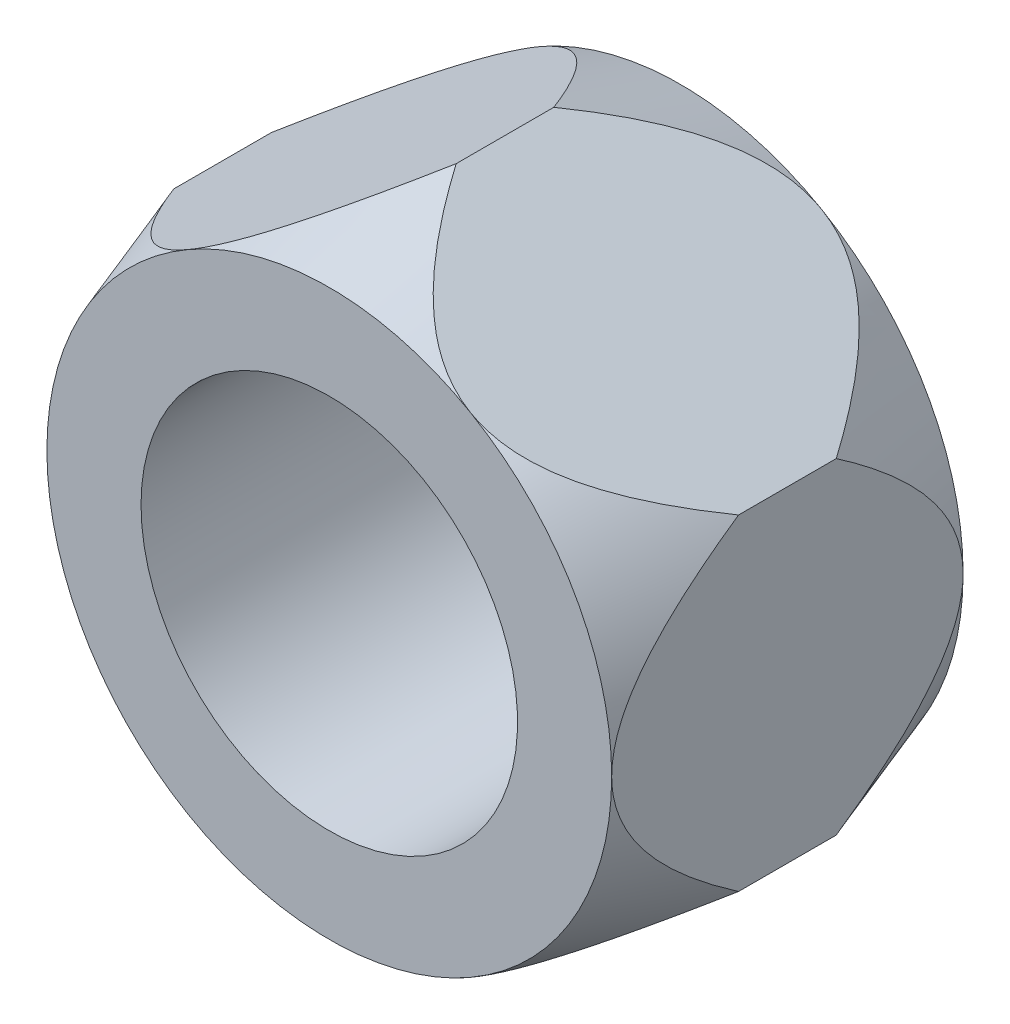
from build123d import *

# Parameters (mm, degrees)
BOSS_EXTRUDE1_DEPTH = 2.8
SKETCH2_OUTSIDE_W   = 9.912
SKETCH2_OUTSIDE_H   = 10.608
SKETCH2_OUTSIDE_R   = 2.25
CUT_EXTRUDE1_DEPTH  = 2.8
CUT_EXTRUDE1_DRAFT  = -19
SKETCH3_OUTSIDE_W   = 9.912
SKETCH3_OUTSIDE_H   = 10.608
SKETCH3_OUTSIDE_R   = 2.25
CUT_EXTRUDE2_DEPTH  = 2.8
CUT_EXTRUDE2_DRAFT  = -19
SKETCH4_R           = 1.5
CUT_EXTRUDE3_DEPTH  = 2.8


with BuildPart() as part:
    # Sketch1 → Boss-Extrude1 (new body)
    with BuildSketch(Plane.XY):
        Polygon((0, 2.598076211), (-2.25, 1.299038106), (-2.25, -1.299038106), (0, -2.598076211), (2.25, -1.299038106), (2.25, 1.299038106), align=None)
    extrude(amount=BOSS_EXTRUDE1_DEPTH)


with BuildPart() as cut_extrude1_tool:
    # Sketch2 outside → Cut-Extrude1 (with draft: the straight prism first)
    with BuildSketch(Plane.XY.offset(2.8)):
        Rectangle(SKETCH2_OUTSIDE_W, SKETCH2_OUTSIDE_H)
        Circle(SKETCH2_OUTSIDE_R, mode=Mode.SUBTRACT)
    extrude(amount=-CUT_EXTRUDE1_DEPTH)
    # Cut-Extrude1: the draft: its side faces are tilted about the plane it starts from
    cut_extrude1_sides = [cut_extrude1_tool.faces().sort_by_distance(p)[0] for p in [
        (0, -5.304, 1.4),
        (4.956, 0, 1.4),
        (0, 5.304, 1.4),
        (-4.956, 0, 1.4),
        (-2.25, 0, 1.4),
    ]]
    draft(cut_extrude1_sides, Plane.XY.offset(2.8), CUT_EXTRUDE1_DRAFT)


with BuildPart() as part_1:
    add(part.part)

    # Cut-Extrude1: cut by cut_extrude1_tool
    add(cut_extrude1_tool.part, mode=Mode.SUBTRACT)


with BuildPart() as cut_extrude2_tool:
    # Sketch3 outside → Cut-Extrude2 (with draft: the straight prism first)
    with BuildSketch(Plane(origin=(0, 0, 0), x_dir=(-1, 0, 0), z_dir=(0, 0, -1))):
        Rectangle(SKETCH3_OUTSIDE_W, SKETCH3_OUTSIDE_H)
        Circle(SKETCH3_OUTSIDE_R, mode=Mode.SUBTRACT)
    extrude(amount=-CUT_EXTRUDE2_DEPTH)
    # Cut-Extrude2: the draft: its side faces are tilted about the plane it starts from
    cut_extrude2_sides = [cut_extrude2_tool.faces().sort_by_distance(p)[0] for p in [
        (0, -5.304, 1.4),
        (-4.956, 0, 1.4),
        (0, 5.304, 1.4),
        (4.956, 0, 1.4),
        (2.25, 0, 1.4),
    ]]
    draft(cut_extrude2_sides, Plane(origin=(0, 0, 0), x_dir=(-1, 0, 0), z_dir=(0, 0, -1)), CUT_EXTRUDE2_DRAFT)


with BuildPart() as part_2:
    add(part_1.part)

    # Cut-Extrude2: cut by cut_extrude2_tool
    add(cut_extrude2_tool.part, mode=Mode.SUBTRACT)

    # Sketch4 → Cut-Extrude3 (cut)
    with BuildSketch(Plane(origin=(0, 0, 0), x_dir=(-1, 0, 0), z_dir=(0, 0, -1))):
        Circle(SKETCH4_R)
    extrude(amount=-CUT_EXTRUDE3_DEPTH, mode=Mode.SUBTRACT)


solid = part_2.part
